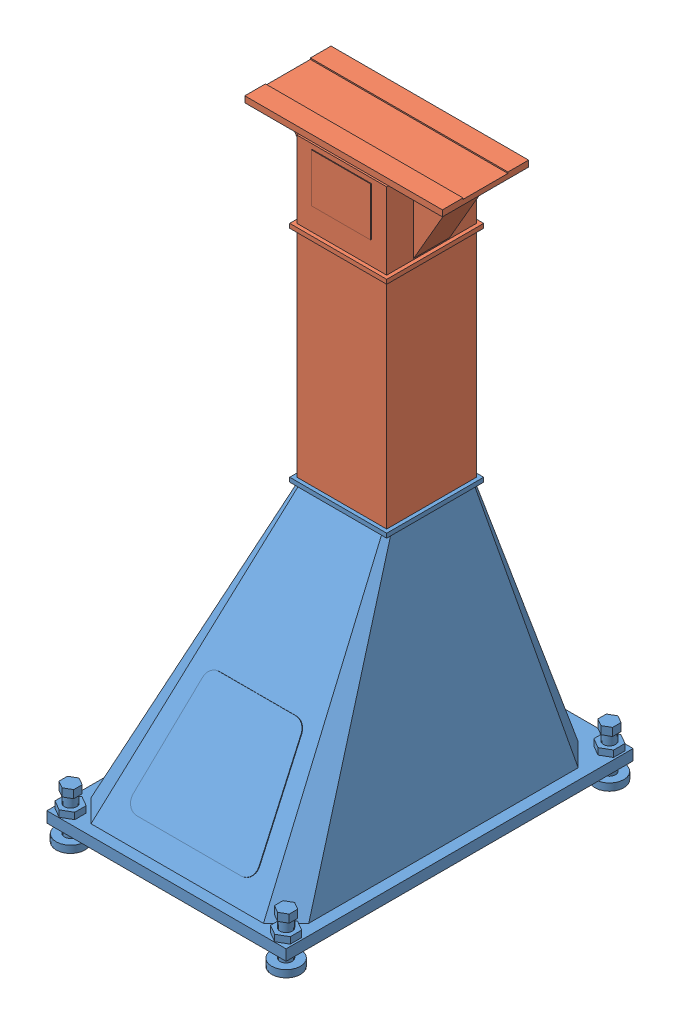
SolidWorks assembly 10-00000617-020.SLDASM, configuration - (file format 10000). Lengths in mm.
Overall size (680 1581 980).
2 component instances, 2 part files, 3 mates.
Components (placement in the parent):
- 10-00000617-018-1: 10-00000617-018.SLDPRT [-] at origin size (680 739 980)
- 10-00000617-019-1: 10-00000617-019.SLDPRT [-] at (0 694 0) x (0 0 1) z (-1 0 0) size (270 842 550)
Mates (geometry in assembly coordinates):
- Abstand1: distance aligned: plane of 10-00000617-019-1 through (-135 1306 135) normal (0 0 1); plane of 10-00000617-018-1 through (135 694 135) normal (0 0 1)
- Abstand2: distance anti-aligned: plane of 10-00000617-018-1 through (0 694 0) normal (0 1 0); plane of 10-00000617-019-1 through (125 694 -125) normal (0 -1 0)
- Abstand3: distance aligned: plane of 10-00000617-019-1 through (135 1306 135) normal (1 0 0); plane of 10-00000617-018-1 through (135 694 135) normal (1 0 0)
